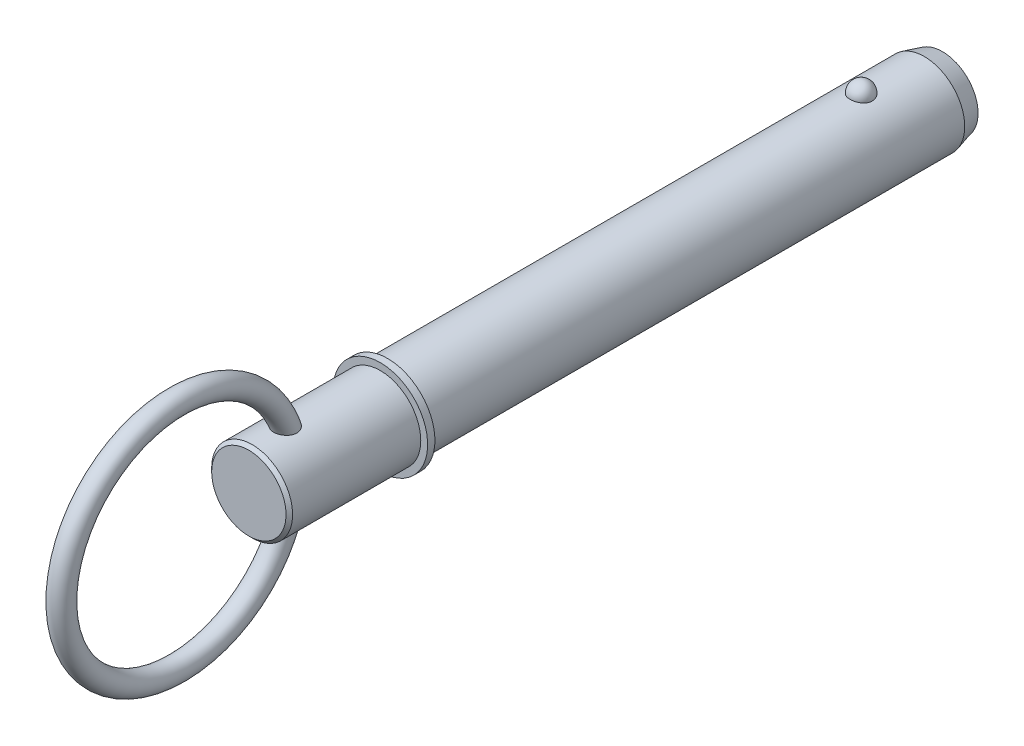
from build123d import *

# Parameters (mm, degrees)
SKETCH2_R           = 11.115
BOSS_EXTRUDE1_DEPTH = 127
BOSS_EXTRUDE2_START = 25.4
SKETCH3_R           = 11.115
BOSS_EXTRUDE2_DEPTH = 25.4
CHAMFER1_SIZE       = 5
CHAMFER1_SIZE2      = 1.339745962
SKETCH20_W          = 2
SKETCH20_H          = 13
SKETCH21_R          = 11.115
BOSS_EXTRUDE3_DEPTH = 38.1
CHAMFER2_SIZE       = 0.9
SKETCH24_R          = 3


with BuildPart() as part:
    # Sketch2 → Boss-Extrude1 (new body)
    with BuildSketch(Plane.XY):
        Circle(SKETCH2_R)
    extrude(amount=BOSS_EXTRUDE1_DEPTH)

    # Sketch3 → Boss-Extrude2 (add)
    with BuildSketch(Plane(origin=(0, 0, 0), x_dir=(-1, 0, 0), z_dir=(0, 0, -1)).offset(BOSS_EXTRUDE2_START)):
        Circle(SKETCH3_R)
    extrude(amount=-BOSS_EXTRUDE2_DEPTH)

    # Chamfer1
    chamfer1_edges = [part.edges().sort_by_distance(p)[0] for p in [
        (11.115, 0, -25.4),
    ]]
    chamfer1_side = [part.faces().sort_by_distance(p)[0] for p in [
        (11.115, 0, -12.7),
    ]]
    chamfer(chamfer1_edges, length=CHAMFER1_SIZE, length2=CHAMFER1_SIZE2, reference=chamfer1_side[0])

    # Sketch18 → Revolve1 (revolve)
    with BuildSketch(Plane(origin=(0, 0, 0), x_dir=(0, 0, -1), z_dir=(1, 0, 0))):
        with BuildLine():
            Line((3.07, 14.185), (3.07, 8.045))
            ThreePointArc((3.07, 8.045), (0, 11.115), (3.07, 14.185))
        make_face()
    revolve(axis=Axis((0, 14.185, -3.07), (0, -1, 0)))

    # Sketch20 → Revolve2 (revolve)
    with BuildSketch(Plane(origin=(0, 0, 0), x_dir=(0, 0, -1), z_dir=(1, 0, 0)), mode=Mode.PRIVATE) as revolve2_sk:
        with Locations((-128, 6.5)):
            Rectangle(SKETCH20_W, SKETCH20_H)
    revolve(revolve2_sk.sketch.rotate(Axis((0, 0, 33.728787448), (0, 0, 1)), 90), axis=Axis((0, 0, 33.728787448), (0, 0, 1)))

    # Sketch21 → Boss-Extrude3 (add)
    with BuildSketch(Plane(origin=(0, 0, 127), x_dir=(-1, 0, 0), z_dir=(0, 0, -1))):
        Circle(SKETCH21_R)
    extrude(amount=-BOSS_EXTRUDE3_DEPTH)

    # Chamfer2
    chamfer2_edges = [part.edges().sort_by_distance(p)[0] for p in [
        (11.115, 0, 165.1),
    ]]
    chamfer(chamfer2_edges, length=CHAMFER2_SIZE)

    # Sweep1: sweep along a path in Sketch23
    with BuildLine(Plane(origin=(0, 0, 0), x_dir=(0, 0, -1), z_dir=(1, 0, 0))) as sweep1_path:
        CenterArc((-184.85, 0), 31.75, 0, 360)
    # Sketch24 → Sweep1 (sweep)
    with BuildSketch(Plane(origin=(0, 0, 0), x_dir=(1, 0, 0), z_dir=(0, 1, 0))):
        with Locations((0, -153.1)):
            Circle(SKETCH24_R)
    sweep(path=sweep1_path.line)


solid = part.part
